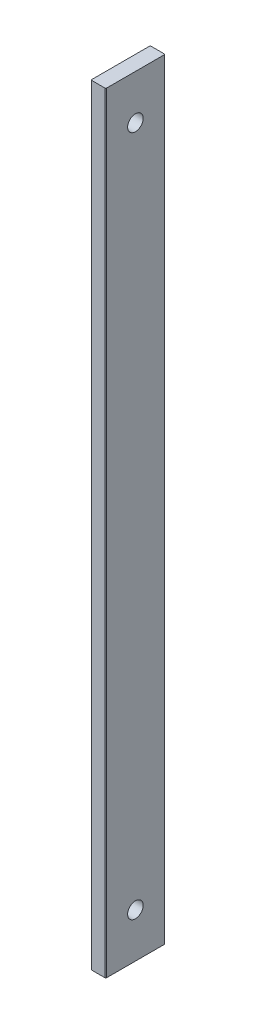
from build123d import *

# Parameters (mm, degrees)
ESQUISSE1_W                       = 520
ESQUISSE1_H                       = 40
BOSS_EXTRU_1_DEPTH                = 10
DIAM_TRE_DU_PER_AGE_10_5_10_5_1_D = 10.5
DIAM_TRE_DU_PER_AGE_10_5_10_5_2_D = 10.5
CONG_1_R                          = 0.5


with BuildPart() as part:
    # Esquisse1 → Boss.-Extru.1 (new body)
    with BuildSketch(Plane(origin=(-5, 0, 0), x_dir=(0, -1, 0), z_dir=(-1, 0, 0))):
        Rectangle(ESQUISSE1_W, ESQUISSE1_H)
    extrude(amount=-BOSS_EXTRU_1_DEPTH)

    # Diam_tre du per_age _10.5 _10.5_1 (through all)
    with Locations(Plane.ZY.offset(5)):
        with Locations((0, -230)):
            Hole(DIAM_TRE_DU_PER_AGE_10_5_10_5_1_D / 2)

    # Diam_tre du per_age _10.5 _10.5_2 (through all)
    with Locations(Plane(origin=(5, 0, 0), x_dir=(0, 0, -1), z_dir=(1, 0, 0))):
        with Locations((0, 230)):
            Hole(DIAM_TRE_DU_PER_AGE_10_5_10_5_2_D / 2)

    # Cong_1
    cong_1_edges = [part.edges().sort_by_distance(p)[0] for p in [
        (5, 0, -20),
        (5, 0, 20),
        (-5, 0, -20),
        (-5, 0, 20),
    ]]
    fillet(cong_1_edges, radius=CONG_1_R)


solid = part.part
